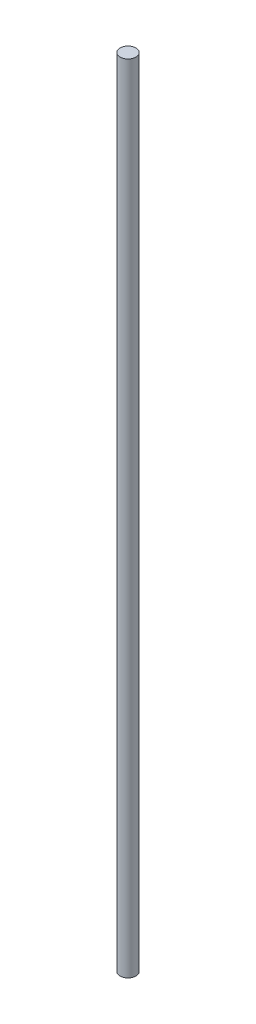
from build123d import *

# Parameters (mm, degrees)
SKETCH_1_R      = 2.5
EXTRUDE_1_DEPTH = 250


with BuildPart() as part:
    # Sketch 1 → Extrude 1 (new body)
    with BuildSketch(Plane(origin=(0, 0, 0), x_dir=(1, 0, 0), z_dir=(0, 1, 0))):
        with Locations(Location((0, 0, 0), (0, 0, 270))):
            Circle(SKETCH_1_R)
    extrude(amount=EXTRUDE_1_DEPTH)


solid = part.part
